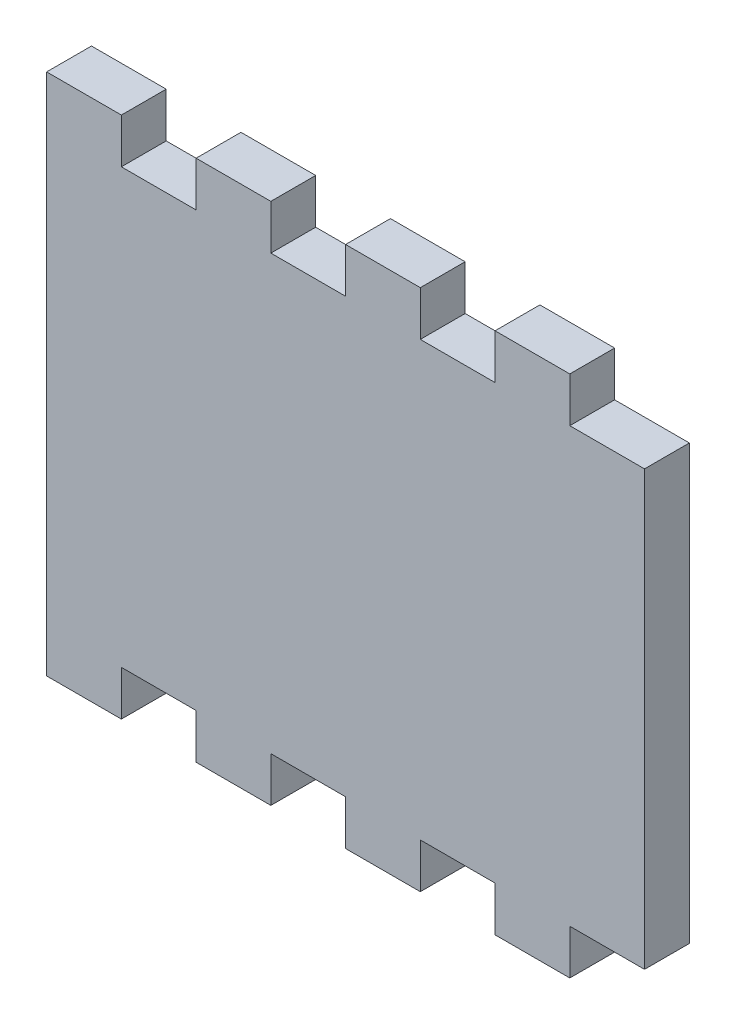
ISO-10303-21;
HEADER;
FILE_DESCRIPTION(('STEP AP214'),'2;1');
FILE_NAME('part.step','',(''),(''),'','','');
FILE_SCHEMA(('AUTOMOTIVE_DESIGN { 1 0 10303 214 1 1 1 1 }'));
ENDSEC;
DATA;
#1=APPLICATION_CONTEXT('core data for automotive mechanical design processes');
#2=APPLICATION_PROTOCOL_DEFINITION('international standard','automotive_design',2000,#1);
#3=PRODUCT_CONTEXT('',#1,'mechanical');
#4=PRODUCT('Part','Part','',(#3));
#5=PRODUCT_RELATED_PRODUCT_CATEGORY('part','',(#4));
#6=PRODUCT_DEFINITION_FORMATION('','',#4);
#7=PRODUCT_DEFINITION_CONTEXT('part definition',#1,'design');
#8=PRODUCT_DEFINITION('design','',#6,#7);
#9=PRODUCT_DEFINITION_SHAPE('','',#8);
#10=(LENGTH_UNIT() NAMED_UNIT(*) SI_UNIT(.MILLI.,.METRE.));
#11=(NAMED_UNIT(*) PLANE_ANGLE_UNIT() SI_UNIT($,.RADIAN.));
#12=(NAMED_UNIT(*) SI_UNIT($,.STERADIAN.) SOLID_ANGLE_UNIT());
#13=UNCERTAINTY_MEASURE_WITH_UNIT(LENGTH_MEASURE(1.E-05),#10,'distance_accuracy_value','');
#14=(GEOMETRIC_REPRESENTATION_CONTEXT(3) GLOBAL_UNCERTAINTY_ASSIGNED_CONTEXT((#13)) GLOBAL_UNIT_ASSIGNED_CONTEXT((#10,
#11,#12)) REPRESENTATION_CONTEXT('',''));
#15=CARTESIAN_POINT('',(0.,0.,0.));
#16=DIRECTION('',(0.,0.,1.));
#17=DIRECTION('',(1.,0.,0.));
#18=AXIS2_PLACEMENT_3D('',#15,#16,#17);
#19=CARTESIAN_POINT('',(-40.,35.,6.));
#20=DIRECTION('',(1.,0.,0.));
#21=DIRECTION('',(0.,0.,-1.));
#22=AXIS2_PLACEMENT_3D('',#19,#20,#21);
#23=PLANE('',#22);
#24=DIRECTION('',(0.,-1.,0.));
#25=VECTOR('',#24,1.);
#26=CARTESIAN_POINT('',(-40.,35.,0.));
#27=LINE('',#26,#25);
#28=CARTESIAN_POINT('',(-40.,35.,0.));
#29=VERTEX_POINT('',#28);
#30=CARTESIAN_POINT('',(-40.,-35.,0.));
#31=VERTEX_POINT('',#30);
#32=EDGE_CURVE('E273',#29,#31,#27,.T.);
#33=ORIENTED_EDGE('',*,*,#32,.T.);
#34=DIRECTION('',(0.,0.,-1.));
#35=VECTOR('',#34,1.);
#36=CARTESIAN_POINT('',(-40.,-35.,6.));
#37=LINE('',#36,#35);
#38=CARTESIAN_POINT('',(-40.,-35.,6.));
#39=VERTEX_POINT('',#38);
#40=EDGE_CURVE('E11',#39,#31,#37,.T.);
#41=ORIENTED_EDGE('',*,*,#40,.F.);
#42=DIRECTION('',(0.,-1.,0.));
#43=VECTOR('',#42,1.);
#44=CARTESIAN_POINT('',(-40.,35.,6.));
#45=LINE('',#44,#43);
#46=CARTESIAN_POINT('',(-40.,35.,6.));
#47=VERTEX_POINT('',#46);
#48=EDGE_CURVE('E335',#47,#39,#45,.T.);
#49=ORIENTED_EDGE('',*,*,#48,.F.);
#50=DIRECTION('',(0.,0.,-1.));
#51=VECTOR('',#50,1.);
#52=CARTESIAN_POINT('',(-40.,35.,6.));
#53=LINE('',#52,#51);
#54=EDGE_CURVE('E269',#47,#29,#53,.T.);
#55=ORIENTED_EDGE('',*,*,#54,.T.);
#56=EDGE_LOOP('',(#33,#41,#49,#55));
#57=FACE_BOUND('',#56,.T.);
#58=ADVANCED_FACE('F33',(#57),#23,.F.);
#59=CARTESIAN_POINT('',(-40.,-35.,6.));
#60=DIRECTION('',(0.,1.,0.));
#61=DIRECTION('',(0.,0.,1.));
#62=AXIS2_PLACEMENT_3D('',#59,#60,#61);
#63=PLANE('',#62);
#64=DIRECTION('',(1.,0.,0.));
#65=VECTOR('',#64,1.);
#66=CARTESIAN_POINT('',(-40.,-35.,0.));
#67=LINE('',#66,#65);
#68=CARTESIAN_POINT('',(-30.,-35.,0.));
#69=VERTEX_POINT('',#68);
#70=EDGE_CURVE('E276',#31,#69,#67,.T.);
#71=ORIENTED_EDGE('',*,*,#70,.T.);
#72=DIRECTION('',(0.,0.,-1.));
#73=VECTOR('',#72,1.);
#74=CARTESIAN_POINT('',(-30.,-35.,6.));
#75=LINE('',#74,#73);
#76=CARTESIAN_POINT('',(-30.,-35.,6.));
#77=VERTEX_POINT('',#76);
#78=EDGE_CURVE('E41',#77,#69,#75,.T.);
#79=ORIENTED_EDGE('',*,*,#78,.F.);
#80=DIRECTION('',(1.,0.,0.));
#81=VECTOR('',#80,1.);
#82=CARTESIAN_POINT('',(-40.,-35.,6.));
#83=LINE('',#82,#81);
#84=EDGE_CURVE('E164',#39,#77,#83,.T.);
#85=ORIENTED_EDGE('',*,*,#84,.F.);
#86=ORIENTED_EDGE('',*,*,#40,.T.);
#87=EDGE_LOOP('',(#71,#79,#85,#86));
#88=FACE_BOUND('',#87,.T.);
#89=ADVANCED_FACE('F513',(#88),#63,.F.);
#90=CARTESIAN_POINT('',(-30.,-35.,6.));
#91=DIRECTION('',(-1.,0.,0.));
#92=DIRECTION('',(0.,-1.,0.));
#93=AXIS2_PLACEMENT_3D('',#90,#91,#92);
#94=PLANE('',#93);
#95=DIRECTION('',(0.,1.,0.));
#96=VECTOR('',#95,1.);
#97=CARTESIAN_POINT('',(-30.,-35.,0.));
#98=LINE('',#97,#96);
#99=CARTESIAN_POINT('',(-30.,-29.,0.));
#100=VERTEX_POINT('',#99);
#101=EDGE_CURVE('E278',#69,#100,#98,.T.);
#102=ORIENTED_EDGE('',*,*,#101,.T.);
#103=DIRECTION('',(0.,0.,-1.));
#104=VECTOR('',#103,1.);
#105=CARTESIAN_POINT('',(-30.,-29.,6.));
#106=LINE('',#105,#104);
#107=CARTESIAN_POINT('',(-30.,-29.,6.));
#108=VERTEX_POINT('',#107);
#109=EDGE_CURVE('E414',#108,#100,#106,.T.);
#110=ORIENTED_EDGE('',*,*,#109,.F.);
#111=DIRECTION('',(0.,1.,0.));
#112=VECTOR('',#111,1.);
#113=CARTESIAN_POINT('',(-30.,-35.,6.));
#114=LINE('',#113,#112);
#115=EDGE_CURVE('E422',#77,#108,#114,.T.);
#116=ORIENTED_EDGE('',*,*,#115,.F.);
#117=ORIENTED_EDGE('',*,*,#78,.T.);
#118=EDGE_LOOP('',(#102,#110,#116,#117));
#119=FACE_BOUND('',#118,.T.);
#120=ADVANCED_FACE('F420',(#119),#94,.F.);
#121=CARTESIAN_POINT('',(-30.,-29.,6.));
#122=DIRECTION('',(0.,1.,0.));
#123=DIRECTION('',(0.,0.,1.));
#124=AXIS2_PLACEMENT_3D('',#121,#122,#123);
#125=PLANE('',#124);
#126=DIRECTION('',(1.,0.,0.));
#127=VECTOR('',#126,1.);
#128=CARTESIAN_POINT('',(-30.,-29.,0.));
#129=LINE('',#128,#127);
#130=CARTESIAN_POINT('',(-20.,-29.,0.));
#131=VERTEX_POINT('',#130);
#132=EDGE_CURVE('E280',#100,#131,#129,.T.);
#133=ORIENTED_EDGE('',*,*,#132,.T.);
#134=DIRECTION('',(0.,0.,-1.));
#135=VECTOR('',#134,1.);
#136=CARTESIAN_POINT('',(-20.,-29.,6.));
#137=LINE('',#136,#135);
#138=CARTESIAN_POINT('',(-20.,-29.,6.));
#139=VERTEX_POINT('',#138);
#140=EDGE_CURVE('E411',#139,#131,#137,.T.);
#141=ORIENTED_EDGE('',*,*,#140,.F.);
#142=DIRECTION('',(1.,0.,0.));
#143=VECTOR('',#142,1.);
#144=CARTESIAN_POINT('',(-30.,-29.,6.));
#145=LINE('',#144,#143);
#146=EDGE_CURVE('E440',#108,#139,#145,.T.);
#147=ORIENTED_EDGE('',*,*,#146,.F.);
#148=ORIENTED_EDGE('',*,*,#109,.T.);
#149=EDGE_LOOP('',(#133,#141,#147,#148));
#150=FACE_BOUND('',#149,.T.);
#151=ADVANCED_FACE('F431',(#150),#125,.F.);
#152=CARTESIAN_POINT('',(-20.,-35.,6.));
#153=DIRECTION('',(1.,0.,0.));
#154=DIRECTION('',(0.,0.,-1.));
#155=AXIS2_PLACEMENT_3D('',#152,#153,#154);
#156=PLANE('',#155);
#157=DIRECTION('',(0.,-1.,0.));
#158=VECTOR('',#157,1.);
#159=CARTESIAN_POINT('',(-20.,-35.,0.));
#160=LINE('',#159,#158);
#161=CARTESIAN_POINT('',(-20.,-35.,0.));
#162=VERTEX_POINT('',#161);
#163=EDGE_CURVE('E282',#131,#162,#160,.T.);
#164=ORIENTED_EDGE('',*,*,#163,.T.);
#165=DIRECTION('',(0.,0.,-1.));
#166=VECTOR('',#165,1.);
#167=CARTESIAN_POINT('',(-20.,-35.,6.));
#168=LINE('',#167,#166);
#169=CARTESIAN_POINT('',(-20.,-35.,6.));
#170=VERTEX_POINT('',#169);
#171=EDGE_CURVE('E408',#170,#162,#168,.T.);
#172=ORIENTED_EDGE('',*,*,#171,.F.);
#173=DIRECTION('',(0.,-1.,0.));
#174=VECTOR('',#173,1.);
#175=CARTESIAN_POINT('',(-20.,-35.,6.));
#176=LINE('',#175,#174);
#177=EDGE_CURVE('E437',#139,#170,#176,.T.);
#178=ORIENTED_EDGE('',*,*,#177,.F.);
#179=ORIENTED_EDGE('',*,*,#140,.T.);
#180=EDGE_LOOP('',(#164,#172,#178,#179));
#181=FACE_BOUND('',#180,.T.);
#182=ADVANCED_FACE('F435',(#181),#156,.F.);
#183=CARTESIAN_POINT('',(-20.,-35.,6.));
#184=DIRECTION('',(0.,1.,0.));
#185=DIRECTION('',(0.,0.,1.));
#186=AXIS2_PLACEMENT_3D('',#183,#184,#185);
#187=PLANE('',#186);
#188=DIRECTION('',(1.,0.,0.));
#189=VECTOR('',#188,1.);
#190=CARTESIAN_POINT('',(-20.,-35.,0.));
#191=LINE('',#190,#189);
#192=CARTESIAN_POINT('',(-10.,-35.,0.));
#193=VERTEX_POINT('',#192);
#194=EDGE_CURVE('E284',#162,#193,#191,.T.);
#195=ORIENTED_EDGE('',*,*,#194,.T.);
#196=DIRECTION('',(0.,0.,-1.));
#197=VECTOR('',#196,1.);
#198=CARTESIAN_POINT('',(-10.,-35.,6.));
#199=LINE('',#198,#197);
#200=CARTESIAN_POINT('',(-10.,-35.,6.));
#201=VERTEX_POINT('',#200);
#202=EDGE_CURVE('E405',#201,#193,#199,.T.);
#203=ORIENTED_EDGE('',*,*,#202,.F.);
#204=DIRECTION('',(1.,0.,0.));
#205=VECTOR('',#204,1.);
#206=CARTESIAN_POINT('',(-20.,-35.,6.));
#207=LINE('',#206,#205);
#208=EDGE_CURVE('E439',#170,#201,#207,.T.);
#209=ORIENTED_EDGE('',*,*,#208,.F.);
#210=ORIENTED_EDGE('',*,*,#171,.T.);
#211=EDGE_LOOP('',(#195,#203,#209,#210));
#212=FACE_BOUND('',#211,.T.);
#213=ADVANCED_FACE('F526',(#212),#187,.F.);
#214=CARTESIAN_POINT('',(-10.,-35.,6.));
#215=DIRECTION('',(-1.,0.,0.));
#216=DIRECTION('',(0.,-1.,0.));
#217=AXIS2_PLACEMENT_3D('',#214,#215,#216);
#218=PLANE('',#217);
#219=DIRECTION('',(0.,1.,0.));
#220=VECTOR('',#219,1.);
#221=CARTESIAN_POINT('',(-10.,-35.,0.));
#222=LINE('',#221,#220);
#223=CARTESIAN_POINT('',(-10.,-29.,0.));
#224=VERTEX_POINT('',#223);
#225=EDGE_CURVE('E286',#193,#224,#222,.T.);
#226=ORIENTED_EDGE('',*,*,#225,.T.);
#227=DIRECTION('',(0.,0.,-1.));
#228=VECTOR('',#227,1.);
#229=CARTESIAN_POINT('',(-10.,-29.,6.));
#230=LINE('',#229,#228);
#231=CARTESIAN_POINT('',(-10.,-29.,6.));
#232=VERTEX_POINT('',#231);
#233=EDGE_CURVE('E402',#232,#224,#230,.T.);
#234=ORIENTED_EDGE('',*,*,#233,.F.);
#235=DIRECTION('',(0.,1.,0.));
#236=VECTOR('',#235,1.);
#237=CARTESIAN_POINT('',(-10.,-35.,6.));
#238=LINE('',#237,#236);
#239=EDGE_CURVE('E442',#201,#232,#238,.T.);
#240=ORIENTED_EDGE('',*,*,#239,.F.);
#241=ORIENTED_EDGE('',*,*,#202,.T.);
#242=EDGE_LOOP('',(#226,#234,#240,#241));
#243=FACE_BOUND('',#242,.T.);
#244=ADVANCED_FACE('F529',(#243),#218,.F.);
#245=CARTESIAN_POINT('',(-10.,-29.,6.));
#246=DIRECTION('',(0.,1.,0.));
#247=DIRECTION('',(0.,0.,1.));
#248=AXIS2_PLACEMENT_3D('',#245,#246,#247);
#249=PLANE('',#248);
#250=DIRECTION('',(1.,0.,0.));
#251=VECTOR('',#250,1.);
#252=CARTESIAN_POINT('',(-10.,-29.,0.));
#253=LINE('',#252,#251);
#254=CARTESIAN_POINT('',(0.,-29.,0.));
#255=VERTEX_POINT('',#254);
#256=EDGE_CURVE('E288',#224,#255,#253,.T.);
#257=ORIENTED_EDGE('',*,*,#256,.T.);
#258=DIRECTION('',(0.,0.,-1.));
#259=VECTOR('',#258,1.);
#260=CARTESIAN_POINT('',(0.,-29.,6.));
#261=LINE('',#260,#259);
#262=CARTESIAN_POINT('',(0.,-29.,6.));
#263=VERTEX_POINT('',#262);
#264=EDGE_CURVE('E399',#263,#255,#261,.T.);
#265=ORIENTED_EDGE('',*,*,#264,.F.);
#266=DIRECTION('',(1.,0.,0.));
#267=VECTOR('',#266,1.);
#268=CARTESIAN_POINT('',(-10.,-29.,6.));
#269=LINE('',#268,#267);
#270=EDGE_CURVE('E448',#232,#263,#269,.T.);
#271=ORIENTED_EDGE('',*,*,#270,.F.);
#272=ORIENTED_EDGE('',*,*,#233,.T.);
#273=EDGE_LOOP('',(#257,#265,#271,#272));
#274=FACE_BOUND('',#273,.T.);
#275=ADVANCED_FACE('F533',(#274),#249,.F.);
#276=CARTESIAN_POINT('',(0.,-35.,6.));
#277=DIRECTION('',(1.,0.,0.));
#278=DIRECTION('',(0.,0.,-1.));
#279=AXIS2_PLACEMENT_3D('',#276,#277,#278);
#280=PLANE('',#279);
#281=DIRECTION('',(0.,-1.,0.));
#282=VECTOR('',#281,1.);
#283=CARTESIAN_POINT('',(0.,-35.,0.));
#284=LINE('',#283,#282);
#285=CARTESIAN_POINT('',(0.,-35.,0.));
#286=VERTEX_POINT('',#285);
#287=EDGE_CURVE('E290',#255,#286,#284,.T.);
#288=ORIENTED_EDGE('',*,*,#287,.T.);
#289=DIRECTION('',(0.,0.,-1.));
#290=VECTOR('',#289,1.);
#291=CARTESIAN_POINT('',(0.,-35.,6.));
#292=LINE('',#291,#290);
#293=CARTESIAN_POINT('',(0.,-35.,6.));
#294=VERTEX_POINT('',#293);
#295=EDGE_CURVE('E396',#294,#286,#292,.T.);
#296=ORIENTED_EDGE('',*,*,#295,.F.);
#297=DIRECTION('',(0.,-1.,0.));
#298=VECTOR('',#297,1.);
#299=CARTESIAN_POINT('',(0.,-35.,6.));
#300=LINE('',#299,#298);
#301=EDGE_CURVE('E450',#263,#294,#300,.T.);
#302=ORIENTED_EDGE('',*,*,#301,.F.);
#303=ORIENTED_EDGE('',*,*,#264,.T.);
#304=EDGE_LOOP('',(#288,#296,#302,#303));
#305=FACE_BOUND('',#304,.T.);
#306=ADVANCED_FACE('F537',(#305),#280,.F.);
#307=CARTESIAN_POINT('',(0.,-35.,6.));
#308=DIRECTION('',(0.,1.,0.));
#309=DIRECTION('',(0.,0.,1.));
#310=AXIS2_PLACEMENT_3D('',#307,#308,#309);
#311=PLANE('',#310);
#312=DIRECTION('',(1.,0.,0.));
#313=VECTOR('',#312,1.);
#314=CARTESIAN_POINT('',(0.,-35.,0.));
#315=LINE('',#314,#313);
#316=CARTESIAN_POINT('',(9.99999999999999,-35.,0.));
#317=VERTEX_POINT('',#316);
#318=EDGE_CURVE('E292',#286,#317,#315,.T.);
#319=ORIENTED_EDGE('',*,*,#318,.T.);
#320=DIRECTION('',(0.,0.,-1.));
#321=VECTOR('',#320,1.);
#322=CARTESIAN_POINT('',(9.99999999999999,-35.,6.));
#323=LINE('',#322,#321);
#324=CARTESIAN_POINT('',(9.99999999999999,-35.,6.));
#325=VERTEX_POINT('',#324);
#326=EDGE_CURVE('E393',#325,#317,#323,.T.);
#327=ORIENTED_EDGE('',*,*,#326,.F.);
#328=DIRECTION('',(1.,0.,0.));
#329=VECTOR('',#328,1.);
#330=CARTESIAN_POINT('',(0.,-35.,6.));
#331=LINE('',#330,#329);
#332=EDGE_CURVE('E452',#294,#325,#331,.T.);
#333=ORIENTED_EDGE('',*,*,#332,.F.);
#334=ORIENTED_EDGE('',*,*,#295,.T.);
#335=EDGE_LOOP('',(#319,#327,#333,#334));
#336=FACE_BOUND('',#335,.T.);
#337=ADVANCED_FACE('F541',(#336),#311,.F.);
#338=CARTESIAN_POINT('',(9.99999999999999,-35.,6.));
#339=DIRECTION('',(-1.,0.,0.));
#340=DIRECTION('',(0.,-1.,0.));
#341=AXIS2_PLACEMENT_3D('',#338,#339,#340);
#342=PLANE('',#341);
#343=DIRECTION('',(0.,1.,0.));
#344=VECTOR('',#343,1.);
#345=CARTESIAN_POINT('',(9.99999999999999,-35.,0.));
#346=LINE('',#345,#344);
#347=CARTESIAN_POINT('',(9.99999999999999,-29.,0.));
#348=VERTEX_POINT('',#347);
#349=EDGE_CURVE('E294',#317,#348,#346,.T.);
#350=ORIENTED_EDGE('',*,*,#349,.T.);
#351=DIRECTION('',(0.,0.,-1.));
#352=VECTOR('',#351,1.);
#353=CARTESIAN_POINT('',(9.99999999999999,-29.,6.));
#354=LINE('',#353,#352);
#355=CARTESIAN_POINT('',(9.99999999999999,-29.,6.));
#356=VERTEX_POINT('',#355);
#357=EDGE_CURVE('E390',#356,#348,#354,.T.);
#358=ORIENTED_EDGE('',*,*,#357,.F.);
#359=DIRECTION('',(0.,1.,0.));
#360=VECTOR('',#359,1.);
#361=CARTESIAN_POINT('',(9.99999999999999,-35.,6.));
#362=LINE('',#361,#360);
#363=EDGE_CURVE('E454',#325,#356,#362,.T.);
#364=ORIENTED_EDGE('',*,*,#363,.F.);
#365=ORIENTED_EDGE('',*,*,#326,.T.);
#366=EDGE_LOOP('',(#350,#358,#364,#365));
#367=FACE_BOUND('',#366,.T.);
#368=ADVANCED_FACE('F545',(#367),#342,.F.);
#369=CARTESIAN_POINT('',(9.99999999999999,-29.,6.));
#370=DIRECTION('',(0.,1.,0.));
#371=DIRECTION('',(0.,0.,1.));
#372=AXIS2_PLACEMENT_3D('',#369,#370,#371);
#373=PLANE('',#372);
#374=DIRECTION('',(1.,0.,0.));
#375=VECTOR('',#374,1.);
#376=CARTESIAN_POINT('',(9.99999999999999,-29.,0.));
#377=LINE('',#376,#375);
#378=CARTESIAN_POINT('',(20.,-29.,0.));
#379=VERTEX_POINT('',#378);
#380=EDGE_CURVE('E296',#348,#379,#377,.T.);
#381=ORIENTED_EDGE('',*,*,#380,.T.);
#382=DIRECTION('',(0.,0.,-1.));
#383=VECTOR('',#382,1.);
#384=CARTESIAN_POINT('',(20.,-29.,6.));
#385=LINE('',#384,#383);
#386=CARTESIAN_POINT('',(20.,-29.,6.));
#387=VERTEX_POINT('',#386);
#388=EDGE_CURVE('E387',#387,#379,#385,.T.);
#389=ORIENTED_EDGE('',*,*,#388,.F.);
#390=DIRECTION('',(1.,0.,0.));
#391=VECTOR('',#390,1.);
#392=CARTESIAN_POINT('',(9.99999999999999,-29.,6.));
#393=LINE('',#392,#391);
#394=EDGE_CURVE('E456',#356,#387,#393,.T.);
#395=ORIENTED_EDGE('',*,*,#394,.F.);
#396=ORIENTED_EDGE('',*,*,#357,.T.);
#397=EDGE_LOOP('',(#381,#389,#395,#396));
#398=FACE_BOUND('',#397,.T.);
#399=ADVANCED_FACE('F549',(#398),#373,.F.);
#400=CARTESIAN_POINT('',(20.,-35.,6.));
#401=DIRECTION('',(1.,0.,0.));
#402=DIRECTION('',(0.,0.,-1.));
#403=AXIS2_PLACEMENT_3D('',#400,#401,#402);
#404=PLANE('',#403);
#405=DIRECTION('',(0.,-1.,0.));
#406=VECTOR('',#405,1.);
#407=CARTESIAN_POINT('',(20.,-35.,0.));
#408=LINE('',#407,#406);
#409=CARTESIAN_POINT('',(20.,-35.,0.));
#410=VERTEX_POINT('',#409);
#411=EDGE_CURVE('E298',#379,#410,#408,.T.);
#412=ORIENTED_EDGE('',*,*,#411,.T.);
#413=DIRECTION('',(0.,0.,-1.));
#414=VECTOR('',#413,1.);
#415=CARTESIAN_POINT('',(20.,-35.,6.));
#416=LINE('',#415,#414);
#417=CARTESIAN_POINT('',(20.,-35.,6.));
#418=VERTEX_POINT('',#417);
#419=EDGE_CURVE('E384',#418,#410,#416,.T.);
#420=ORIENTED_EDGE('',*,*,#419,.F.);
#421=DIRECTION('',(0.,-1.,0.));
#422=VECTOR('',#421,1.);
#423=CARTESIAN_POINT('',(20.,-35.,6.));
#424=LINE('',#423,#422);
#425=EDGE_CURVE('E458',#387,#418,#424,.T.);
#426=ORIENTED_EDGE('',*,*,#425,.F.);
#427=ORIENTED_EDGE('',*,*,#388,.T.);
#428=EDGE_LOOP('',(#412,#420,#426,#427));
#429=FACE_BOUND('',#428,.T.);
#430=ADVANCED_FACE('F553',(#429),#404,.F.);
#431=CARTESIAN_POINT('',(20.,-35.,6.));
#432=DIRECTION('',(0.,1.,0.));
#433=DIRECTION('',(0.,0.,1.));
#434=AXIS2_PLACEMENT_3D('',#431,#432,#433);
#435=PLANE('',#434);
#436=DIRECTION('',(1.,0.,0.));
#437=VECTOR('',#436,1.);
#438=CARTESIAN_POINT('',(20.,-35.,0.));
#439=LINE('',#438,#437);
#440=CARTESIAN_POINT('',(30.,-35.,0.));
#441=VERTEX_POINT('',#440);
#442=EDGE_CURVE('E300',#410,#441,#439,.T.);
#443=ORIENTED_EDGE('',*,*,#442,.T.);
#444=DIRECTION('',(0.,0.,-1.));
#445=VECTOR('',#444,1.);
#446=CARTESIAN_POINT('',(30.,-35.,6.));
#447=LINE('',#446,#445);
#448=CARTESIAN_POINT('',(30.,-35.,6.));
#449=VERTEX_POINT('',#448);
#450=EDGE_CURVE('E381',#449,#441,#447,.T.);
#451=ORIENTED_EDGE('',*,*,#450,.F.);
#452=DIRECTION('',(1.,0.,0.));
#453=VECTOR('',#452,1.);
#454=CARTESIAN_POINT('',(20.,-35.,6.));
#455=LINE('',#454,#453);
#456=EDGE_CURVE('E460',#418,#449,#455,.T.);
#457=ORIENTED_EDGE('',*,*,#456,.F.);
#458=ORIENTED_EDGE('',*,*,#419,.T.);
#459=EDGE_LOOP('',(#443,#451,#457,#458));
#460=FACE_BOUND('',#459,.T.);
#461=ADVANCED_FACE('F557',(#460),#435,.F.);
#462=CARTESIAN_POINT('',(30.,-35.,6.));
#463=DIRECTION('',(-1.,0.,0.));
#464=DIRECTION('',(0.,-1.,0.));
#465=AXIS2_PLACEMENT_3D('',#462,#463,#464);
#466=PLANE('',#465);
#467=DIRECTION('',(0.,1.,0.));
#468=VECTOR('',#467,1.);
#469=CARTESIAN_POINT('',(30.,-35.,0.));
#470=LINE('',#469,#468);
#471=CARTESIAN_POINT('',(30.,-29.,0.));
#472=VERTEX_POINT('',#471);
#473=EDGE_CURVE('E302',#441,#472,#470,.T.);
#474=ORIENTED_EDGE('',*,*,#473,.T.);
#475=DIRECTION('',(0.,0.,-1.));
#476=VECTOR('',#475,1.);
#477=CARTESIAN_POINT('',(30.,-29.,6.));
#478=LINE('',#477,#476);
#479=CARTESIAN_POINT('',(30.,-29.,6.));
#480=VERTEX_POINT('',#479);
#481=EDGE_CURVE('E378',#480,#472,#478,.T.);
#482=ORIENTED_EDGE('',*,*,#481,.F.);
#483=DIRECTION('',(0.,1.,0.));
#484=VECTOR('',#483,1.);
#485=CARTESIAN_POINT('',(30.,-35.,6.));
#486=LINE('',#485,#484);
#487=EDGE_CURVE('E462',#449,#480,#486,.T.);
#488=ORIENTED_EDGE('',*,*,#487,.F.);
#489=ORIENTED_EDGE('',*,*,#450,.T.);
#490=EDGE_LOOP('',(#474,#482,#488,#489));
#491=FACE_BOUND('',#490,.T.);
#492=ADVANCED_FACE('F561',(#491),#466,.F.);
#493=CARTESIAN_POINT('',(30.,-29.,6.));
#494=DIRECTION('',(0.,1.,0.));
#495=DIRECTION('',(0.,0.,1.));
#496=AXIS2_PLACEMENT_3D('',#493,#494,#495);
#497=PLANE('',#496);
#498=DIRECTION('',(1.,0.,0.));
#499=VECTOR('',#498,1.);
#500=CARTESIAN_POINT('',(30.,-29.,0.));
#501=LINE('',#500,#499);
#502=CARTESIAN_POINT('',(40.,-29.,0.));
#503=VERTEX_POINT('',#502);
#504=EDGE_CURVE('E304',#472,#503,#501,.T.);
#505=ORIENTED_EDGE('',*,*,#504,.T.);
#506=DIRECTION('',(0.,0.,-1.));
#507=VECTOR('',#506,1.);
#508=CARTESIAN_POINT('',(40.,-29.,6.));
#509=LINE('',#508,#507);
#510=CARTESIAN_POINT('',(40.,-29.,6.));
#511=VERTEX_POINT('',#510);
#512=EDGE_CURVE('E375',#511,#503,#509,.T.);
#513=ORIENTED_EDGE('',*,*,#512,.F.);
#514=DIRECTION('',(1.,0.,0.));
#515=VECTOR('',#514,1.);
#516=CARTESIAN_POINT('',(30.,-29.,6.));
#517=LINE('',#516,#515);
#518=EDGE_CURVE('E464',#480,#511,#517,.T.);
#519=ORIENTED_EDGE('',*,*,#518,.F.);
#520=ORIENTED_EDGE('',*,*,#481,.T.);
#521=EDGE_LOOP('',(#505,#513,#519,#520));
#522=FACE_BOUND('',#521,.T.);
#523=ADVANCED_FACE('F565',(#522),#497,.F.);
#524=CARTESIAN_POINT('',(40.,29.,6.));
#525=DIRECTION('',(-1.,0.,0.));
#526=DIRECTION('',(0.,0.,1.));
#527=AXIS2_PLACEMENT_3D('',#524,#525,#526);
#528=PLANE('',#527);
#529=DIRECTION('',(0.,1.,0.));
#530=VECTOR('',#529,1.);
#531=CARTESIAN_POINT('',(40.,29.,0.));
#532=LINE('',#531,#530);
#533=CARTESIAN_POINT('',(40.,29.,0.));
#534=VERTEX_POINT('',#533);
#535=EDGE_CURVE('E306',#503,#534,#532,.T.);
#536=ORIENTED_EDGE('',*,*,#535,.T.);
#537=DIRECTION('',(0.,0.,-1.));
#538=VECTOR('',#537,1.);
#539=CARTESIAN_POINT('',(40.,29.,6.));
#540=LINE('',#539,#538);
#541=CARTESIAN_POINT('',(40.,29.,6.));
#542=VERTEX_POINT('',#541);
#543=EDGE_CURVE('E372',#542,#534,#540,.T.);
#544=ORIENTED_EDGE('',*,*,#543,.F.);
#545=DIRECTION('',(0.,1.,0.));
#546=VECTOR('',#545,1.);
#547=CARTESIAN_POINT('',(40.,29.,6.));
#548=LINE('',#547,#546);
#549=EDGE_CURVE('E466',#511,#542,#548,.T.);
#550=ORIENTED_EDGE('',*,*,#549,.F.);
#551=ORIENTED_EDGE('',*,*,#512,.T.);
#552=EDGE_LOOP('',(#536,#544,#550,#551));
#553=FACE_BOUND('',#552,.T.);
#554=ADVANCED_FACE('F569',(#553),#528,.F.);
#555=CARTESIAN_POINT('',(30.,29.,6.));
#556=DIRECTION('',(0.,-1.,0.));
#557=DIRECTION('',(0.,0.,-1.));
#558=AXIS2_PLACEMENT_3D('',#555,#556,#557);
#559=PLANE('',#558);
#560=DIRECTION('',(-1.,0.,0.));
#561=VECTOR('',#560,1.);
#562=CARTESIAN_POINT('',(30.,29.,0.));
#563=LINE('',#562,#561);
#564=CARTESIAN_POINT('',(30.,29.,0.));
#565=VERTEX_POINT('',#564);
#566=EDGE_CURVE('E308',#534,#565,#563,.T.);
#567=ORIENTED_EDGE('',*,*,#566,.T.);
#568=DIRECTION('',(0.,0.,-1.));
#569=VECTOR('',#568,1.);
#570=CARTESIAN_POINT('',(30.,29.,6.));
#571=LINE('',#570,#569);
#572=CARTESIAN_POINT('',(30.,29.,6.));
#573=VERTEX_POINT('',#572);
#574=EDGE_CURVE('E369',#573,#565,#571,.T.);
#575=ORIENTED_EDGE('',*,*,#574,.F.);
#576=DIRECTION('',(-1.,0.,0.));
#577=VECTOR('',#576,1.);
#578=CARTESIAN_POINT('',(30.,29.,6.));
#579=LINE('',#578,#577);
#580=EDGE_CURVE('E468',#542,#573,#579,.T.);
#581=ORIENTED_EDGE('',*,*,#580,.F.);
#582=ORIENTED_EDGE('',*,*,#543,.T.);
#583=EDGE_LOOP('',(#567,#575,#581,#582));
#584=FACE_BOUND('',#583,.T.);
#585=ADVANCED_FACE('F573',(#584),#559,.F.);
#586=CARTESIAN_POINT('',(30.,35.,6.));
#587=DIRECTION('',(-1.,0.,0.));
#588=DIRECTION('',(0.,-1.,0.));
#589=AXIS2_PLACEMENT_3D('',#586,#587,#588);
#590=PLANE('',#589);
#591=DIRECTION('',(0.,1.,0.));
#592=VECTOR('',#591,1.);
#593=CARTESIAN_POINT('',(30.,35.,0.));
#594=LINE('',#593,#592);
#595=CARTESIAN_POINT('',(30.,35.,0.));
#596=VERTEX_POINT('',#595);
#597=EDGE_CURVE('E310',#565,#596,#594,.T.);
#598=ORIENTED_EDGE('',*,*,#597,.T.);
#599=DIRECTION('',(0.,0.,-1.));
#600=VECTOR('',#599,1.);
#601=CARTESIAN_POINT('',(30.,35.,6.));
#602=LINE('',#601,#600);
#603=CARTESIAN_POINT('',(30.,35.,6.));
#604=VERTEX_POINT('',#603);
#605=EDGE_CURVE('E366',#604,#596,#602,.T.);
#606=ORIENTED_EDGE('',*,*,#605,.F.);
#607=DIRECTION('',(0.,1.,0.));
#608=VECTOR('',#607,1.);
#609=CARTESIAN_POINT('',(30.,35.,6.));
#610=LINE('',#609,#608);
#611=EDGE_CURVE('E470',#573,#604,#610,.T.);
#612=ORIENTED_EDGE('',*,*,#611,.F.);
#613=ORIENTED_EDGE('',*,*,#574,.T.);
#614=EDGE_LOOP('',(#598,#606,#612,#613));
#615=FACE_BOUND('',#614,.T.);
#616=ADVANCED_FACE('F577',(#615),#590,.F.);
#617=CARTESIAN_POINT('',(20.,35.,6.));
#618=DIRECTION('',(0.,-1.,0.));
#619=DIRECTION('',(0.,0.,-1.));
#620=AXIS2_PLACEMENT_3D('',#617,#618,#619);
#621=PLANE('',#620);
#622=DIRECTION('',(-1.,0.,0.));
#623=VECTOR('',#622,1.);
#624=CARTESIAN_POINT('',(20.,35.,0.));
#625=LINE('',#624,#623);
#626=CARTESIAN_POINT('',(20.,35.,0.));
#627=VERTEX_POINT('',#626);
#628=EDGE_CURVE('E312',#596,#627,#625,.T.);
#629=ORIENTED_EDGE('',*,*,#628,.T.);
#630=DIRECTION('',(0.,0.,-1.));
#631=VECTOR('',#630,1.);
#632=CARTESIAN_POINT('',(20.,35.,6.));
#633=LINE('',#632,#631);
#634=CARTESIAN_POINT('',(20.,35.,6.));
#635=VERTEX_POINT('',#634);
#636=EDGE_CURVE('E363',#635,#627,#633,.T.);
#637=ORIENTED_EDGE('',*,*,#636,.F.);
#638=DIRECTION('',(-1.,0.,0.));
#639=VECTOR('',#638,1.);
#640=CARTESIAN_POINT('',(20.,35.,6.));
#641=LINE('',#640,#639);
#642=EDGE_CURVE('E472',#604,#635,#641,.T.);
#643=ORIENTED_EDGE('',*,*,#642,.F.);
#644=ORIENTED_EDGE('',*,*,#605,.T.);
#645=EDGE_LOOP('',(#629,#637,#643,#644));
#646=FACE_BOUND('',#645,.T.);
#647=ADVANCED_FACE('F581',(#646),#621,.F.);
#648=CARTESIAN_POINT('',(20.,35.,6.));
#649=DIRECTION('',(1.,0.,0.));
#650=DIRECTION('',(0.,0.,-1.));
#651=AXIS2_PLACEMENT_3D('',#648,#649,#650);
#652=PLANE('',#651);
#653=DIRECTION('',(0.,-1.,0.));
#654=VECTOR('',#653,1.);
#655=CARTESIAN_POINT('',(20.,35.,0.));
#656=LINE('',#655,#654);
#657=CARTESIAN_POINT('',(20.,29.,0.));
#658=VERTEX_POINT('',#657);
#659=EDGE_CURVE('E314',#627,#658,#656,.T.);
#660=ORIENTED_EDGE('',*,*,#659,.T.);
#661=DIRECTION('',(0.,0.,-1.));
#662=VECTOR('',#661,1.);
#663=CARTESIAN_POINT('',(20.,29.,6.));
#664=LINE('',#663,#662);
#665=CARTESIAN_POINT('',(20.,29.,6.));
#666=VERTEX_POINT('',#665);
#667=EDGE_CURVE('E360',#666,#658,#664,.T.);
#668=ORIENTED_EDGE('',*,*,#667,.F.);
#669=DIRECTION('',(0.,-1.,0.));
#670=VECTOR('',#669,1.);
#671=CARTESIAN_POINT('',(20.,35.,6.));
#672=LINE('',#671,#670);
#673=EDGE_CURVE('E474',#635,#666,#672,.T.);
#674=ORIENTED_EDGE('',*,*,#673,.F.);
#675=ORIENTED_EDGE('',*,*,#636,.T.);
#676=EDGE_LOOP('',(#660,#668,#674,#675));
#677=FACE_BOUND('',#676,.T.);
#678=ADVANCED_FACE('F585',(#677),#652,.F.);
#679=CARTESIAN_POINT('',(9.99999999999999,29.,6.));
#680=DIRECTION('',(0.,-1.,0.));
#681=DIRECTION('',(0.,0.,-1.));
#682=AXIS2_PLACEMENT_3D('',#679,#680,#681);
#683=PLANE('',#682);
#684=DIRECTION('',(-1.,0.,0.));
#685=VECTOR('',#684,1.);
#686=CARTESIAN_POINT('',(9.99999999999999,29.,0.));
#687=LINE('',#686,#685);
#688=CARTESIAN_POINT('',(9.99999999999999,29.,0.));
#689=VERTEX_POINT('',#688);
#690=EDGE_CURVE('E316',#658,#689,#687,.T.);
#691=ORIENTED_EDGE('',*,*,#690,.T.);
#692=DIRECTION('',(0.,0.,-1.));
#693=VECTOR('',#692,1.);
#694=CARTESIAN_POINT('',(9.99999999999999,29.,6.));
#695=LINE('',#694,#693);
#696=CARTESIAN_POINT('',(9.99999999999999,29.,6.));
#697=VERTEX_POINT('',#696);
#698=EDGE_CURVE('E357',#697,#689,#695,.T.);
#699=ORIENTED_EDGE('',*,*,#698,.F.);
#700=DIRECTION('',(-1.,0.,0.));
#701=VECTOR('',#700,1.);
#702=CARTESIAN_POINT('',(9.99999999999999,29.,6.));
#703=LINE('',#702,#701);
#704=EDGE_CURVE('E476',#666,#697,#703,.T.);
#705=ORIENTED_EDGE('',*,*,#704,.F.);
#706=ORIENTED_EDGE('',*,*,#667,.T.);
#707=EDGE_LOOP('',(#691,#699,#705,#706));
#708=FACE_BOUND('',#707,.T.);
#709=ADVANCED_FACE('F589',(#708),#683,.F.);
#710=CARTESIAN_POINT('',(9.99999999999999,35.,6.));
#711=DIRECTION('',(-1.,0.,0.));
#712=DIRECTION('',(0.,-1.,0.));
#713=AXIS2_PLACEMENT_3D('',#710,#711,#712);
#714=PLANE('',#713);
#715=DIRECTION('',(0.,1.,0.));
#716=VECTOR('',#715,1.);
#717=CARTESIAN_POINT('',(9.99999999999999,35.,0.));
#718=LINE('',#717,#716);
#719=CARTESIAN_POINT('',(9.99999999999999,35.,0.));
#720=VERTEX_POINT('',#719);
#721=EDGE_CURVE('E318',#689,#720,#718,.T.);
#722=ORIENTED_EDGE('',*,*,#721,.T.);
#723=DIRECTION('',(0.,0.,-1.));
#724=VECTOR('',#723,1.);
#725=CARTESIAN_POINT('',(9.99999999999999,35.,6.));
#726=LINE('',#725,#724);
#727=CARTESIAN_POINT('',(9.99999999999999,35.,6.));
#728=VERTEX_POINT('',#727);
#729=EDGE_CURVE('E354',#728,#720,#726,.T.);
#730=ORIENTED_EDGE('',*,*,#729,.F.);
#731=DIRECTION('',(0.,1.,0.));
#732=VECTOR('',#731,1.);
#733=CARTESIAN_POINT('',(9.99999999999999,35.,6.));
#734=LINE('',#733,#732);
#735=EDGE_CURVE('E478',#697,#728,#734,.T.);
#736=ORIENTED_EDGE('',*,*,#735,.F.);
#737=ORIENTED_EDGE('',*,*,#698,.T.);
#738=EDGE_LOOP('',(#722,#730,#736,#737));
#739=FACE_BOUND('',#738,.T.);
#740=ADVANCED_FACE('F593',(#739),#714,.F.);
#741=CARTESIAN_POINT('',(0.,35.,6.));
#742=DIRECTION('',(0.,-1.,0.));
#743=DIRECTION('',(0.,0.,-1.));
#744=AXIS2_PLACEMENT_3D('',#741,#742,#743);
#745=PLANE('',#744);
#746=DIRECTION('',(-1.,0.,0.));
#747=VECTOR('',#746,1.);
#748=CARTESIAN_POINT('',(0.,35.,0.));
#749=LINE('',#748,#747);
#750=CARTESIAN_POINT('',(0.,35.,0.));
#751=VERTEX_POINT('',#750);
#752=EDGE_CURVE('E320',#720,#751,#749,.T.);
#753=ORIENTED_EDGE('',*,*,#752,.T.);
#754=DIRECTION('',(0.,0.,-1.));
#755=VECTOR('',#754,1.);
#756=CARTESIAN_POINT('',(0.,35.,6.));
#757=LINE('',#756,#755);
#758=CARTESIAN_POINT('',(0.,35.,6.));
#759=VERTEX_POINT('',#758);
#760=EDGE_CURVE('E351',#759,#751,#757,.T.);
#761=ORIENTED_EDGE('',*,*,#760,.F.);
#762=DIRECTION('',(-1.,0.,0.));
#763=VECTOR('',#762,1.);
#764=CARTESIAN_POINT('',(0.,35.,6.));
#765=LINE('',#764,#763);
#766=EDGE_CURVE('E480',#728,#759,#765,.T.);
#767=ORIENTED_EDGE('',*,*,#766,.F.);
#768=ORIENTED_EDGE('',*,*,#729,.T.);
#769=EDGE_LOOP('',(#753,#761,#767,#768));
#770=FACE_BOUND('',#769,.T.);
#771=ADVANCED_FACE('F597',(#770),#745,.F.);
#772=CARTESIAN_POINT('',(0.,35.,6.));
#773=DIRECTION('',(1.,0.,0.));
#774=DIRECTION('',(0.,0.,-1.));
#775=AXIS2_PLACEMENT_3D('',#772,#773,#774);
#776=PLANE('',#775);
#777=DIRECTION('',(0.,-1.,0.));
#778=VECTOR('',#777,1.);
#779=CARTESIAN_POINT('',(0.,35.,0.));
#780=LINE('',#779,#778);
#781=CARTESIAN_POINT('',(0.,29.,0.));
#782=VERTEX_POINT('',#781);
#783=EDGE_CURVE('E322',#751,#782,#780,.T.);
#784=ORIENTED_EDGE('',*,*,#783,.T.);
#785=DIRECTION('',(0.,0.,-1.));
#786=VECTOR('',#785,1.);
#787=CARTESIAN_POINT('',(0.,29.,6.));
#788=LINE('',#787,#786);
#789=CARTESIAN_POINT('',(0.,29.,6.));
#790=VERTEX_POINT('',#789);
#791=EDGE_CURVE('E348',#790,#782,#788,.T.);
#792=ORIENTED_EDGE('',*,*,#791,.F.);
#793=DIRECTION('',(0.,-1.,0.));
#794=VECTOR('',#793,1.);
#795=CARTESIAN_POINT('',(0.,35.,6.));
#796=LINE('',#795,#794);
#797=EDGE_CURVE('E482',#759,#790,#796,.T.);
#798=ORIENTED_EDGE('',*,*,#797,.F.);
#799=ORIENTED_EDGE('',*,*,#760,.T.);
#800=EDGE_LOOP('',(#784,#792,#798,#799));
#801=FACE_BOUND('',#800,.T.);
#802=ADVANCED_FACE('F601',(#801),#776,.F.);
#803=CARTESIAN_POINT('',(-10.,29.,6.));
#804=DIRECTION('',(0.,-1.,0.));
#805=DIRECTION('',(0.,0.,-1.));
#806=AXIS2_PLACEMENT_3D('',#803,#804,#805);
#807=PLANE('',#806);
#808=DIRECTION('',(-1.,0.,0.));
#809=VECTOR('',#808,1.);
#810=CARTESIAN_POINT('',(-10.,29.,0.));
#811=LINE('',#810,#809);
#812=CARTESIAN_POINT('',(-10.,29.,0.));
#813=VERTEX_POINT('',#812);
#814=EDGE_CURVE('E324',#782,#813,#811,.T.);
#815=ORIENTED_EDGE('',*,*,#814,.T.);
#816=DIRECTION('',(0.,0.,-1.));
#817=VECTOR('',#816,1.);
#818=CARTESIAN_POINT('',(-10.,29.,6.));
#819=LINE('',#818,#817);
#820=CARTESIAN_POINT('',(-10.,29.,6.));
#821=VERTEX_POINT('',#820);
#822=EDGE_CURVE('E345',#821,#813,#819,.T.);
#823=ORIENTED_EDGE('',*,*,#822,.F.);
#824=DIRECTION('',(-1.,0.,0.));
#825=VECTOR('',#824,1.);
#826=CARTESIAN_POINT('',(-10.,29.,6.));
#827=LINE('',#826,#825);
#828=EDGE_CURVE('E484',#790,#821,#827,.T.);
#829=ORIENTED_EDGE('',*,*,#828,.F.);
#830=ORIENTED_EDGE('',*,*,#791,.T.);
#831=EDGE_LOOP('',(#815,#823,#829,#830));
#832=FACE_BOUND('',#831,.T.);
#833=ADVANCED_FACE('F605',(#832),#807,.F.);
#834=CARTESIAN_POINT('',(-10.,35.,6.));
#835=DIRECTION('',(-1.,0.,0.));
#836=DIRECTION('',(0.,-1.,0.));
#837=AXIS2_PLACEMENT_3D('',#834,#835,#836);
#838=PLANE('',#837);
#839=DIRECTION('',(0.,1.,0.));
#840=VECTOR('',#839,1.);
#841=CARTESIAN_POINT('',(-10.,35.,0.));
#842=LINE('',#841,#840);
#843=CARTESIAN_POINT('',(-10.,35.,0.));
#844=VERTEX_POINT('',#843);
#845=EDGE_CURVE('E326',#813,#844,#842,.T.);
#846=ORIENTED_EDGE('',*,*,#845,.T.);
#847=DIRECTION('',(0.,0.,-1.));
#848=VECTOR('',#847,1.);
#849=CARTESIAN_POINT('',(-10.,35.,6.));
#850=LINE('',#849,#848);
#851=CARTESIAN_POINT('',(-10.,35.,6.));
#852=VERTEX_POINT('',#851);
#853=EDGE_CURVE('E342',#852,#844,#850,.T.);
#854=ORIENTED_EDGE('',*,*,#853,.F.);
#855=DIRECTION('',(0.,1.,0.));
#856=VECTOR('',#855,1.);
#857=CARTESIAN_POINT('',(-10.,35.,6.));
#858=LINE('',#857,#856);
#859=EDGE_CURVE('E486',#821,#852,#858,.T.);
#860=ORIENTED_EDGE('',*,*,#859,.F.);
#861=ORIENTED_EDGE('',*,*,#822,.T.);
#862=EDGE_LOOP('',(#846,#854,#860,#861));
#863=FACE_BOUND('',#862,.T.);
#864=ADVANCED_FACE('F609',(#863),#838,.F.);
#865=CARTESIAN_POINT('',(-20.,35.,6.));
#866=DIRECTION('',(0.,-1.,0.));
#867=DIRECTION('',(0.,0.,-1.));
#868=AXIS2_PLACEMENT_3D('',#865,#866,#867);
#869=PLANE('',#868);
#870=DIRECTION('',(-1.,0.,0.));
#871=VECTOR('',#870,1.);
#872=CARTESIAN_POINT('',(-20.,35.,0.));
#873=LINE('',#872,#871);
#874=CARTESIAN_POINT('',(-20.,35.,0.));
#875=VERTEX_POINT('',#874);
#876=EDGE_CURVE('E328',#844,#875,#873,.T.);
#877=ORIENTED_EDGE('',*,*,#876,.T.);
#878=DIRECTION('',(0.,0.,-1.));
#879=VECTOR('',#878,1.);
#880=CARTESIAN_POINT('',(-20.,35.,6.));
#881=LINE('',#880,#879);
#882=CARTESIAN_POINT('',(-20.,35.,6.));
#883=VERTEX_POINT('',#882);
#884=EDGE_CURVE('E339',#883,#875,#881,.T.);
#885=ORIENTED_EDGE('',*,*,#884,.F.);
#886=DIRECTION('',(-1.,0.,0.));
#887=VECTOR('',#886,1.);
#888=CARTESIAN_POINT('',(-20.,35.,6.));
#889=LINE('',#888,#887);
#890=EDGE_CURVE('E488',#852,#883,#889,.T.);
#891=ORIENTED_EDGE('',*,*,#890,.F.);
#892=ORIENTED_EDGE('',*,*,#853,.T.);
#893=EDGE_LOOP('',(#877,#885,#891,#892));
#894=FACE_BOUND('',#893,.T.);
#895=ADVANCED_FACE('F494',(#894),#869,.F.);
#896=CARTESIAN_POINT('',(-20.,35.,6.));
#897=DIRECTION('',(1.,0.,0.));
#898=DIRECTION('',(0.,0.,-1.));
#899=AXIS2_PLACEMENT_3D('',#896,#897,#898);
#900=PLANE('',#899);
#901=DIRECTION('',(0.,-1.,0.));
#902=VECTOR('',#901,1.);
#903=CARTESIAN_POINT('',(-20.,35.,0.));
#904=LINE('',#903,#902);
#905=CARTESIAN_POINT('',(-20.,29.,0.));
#906=VERTEX_POINT('',#905);
#907=EDGE_CURVE('E330',#875,#906,#904,.T.);
#908=ORIENTED_EDGE('',*,*,#907,.T.);
#909=DIRECTION('',(0.,0.,-1.));
#910=VECTOR('',#909,1.);
#911=CARTESIAN_POINT('',(-20.,29.,6.));
#912=LINE('',#911,#910);
#913=CARTESIAN_POINT('',(-20.,29.,6.));
#914=VERTEX_POINT('',#913);
#915=EDGE_CURVE('E264',#914,#906,#912,.T.);
#916=ORIENTED_EDGE('',*,*,#915,.F.);
#917=DIRECTION('',(0.,-1.,0.));
#918=VECTOR('',#917,1.);
#919=CARTESIAN_POINT('',(-20.,35.,6.));
#920=LINE('',#919,#918);
#921=EDGE_CURVE('E255',#883,#914,#920,.T.);
#922=ORIENTED_EDGE('',*,*,#921,.F.);
#923=ORIENTED_EDGE('',*,*,#884,.T.);
#924=EDGE_LOOP('',(#908,#916,#922,#923));
#925=FACE_BOUND('',#924,.T.);
#926=ADVANCED_FACE('F498',(#925),#900,.F.);
#927=CARTESIAN_POINT('',(-30.,29.,6.));
#928=DIRECTION('',(0.,-1.,0.));
#929=DIRECTION('',(0.,0.,-1.));
#930=AXIS2_PLACEMENT_3D('',#927,#928,#929);
#931=PLANE('',#930);
#932=DIRECTION('',(-1.,0.,0.));
#933=VECTOR('',#932,1.);
#934=CARTESIAN_POINT('',(-30.,29.,0.));
#935=LINE('',#934,#933);
#936=CARTESIAN_POINT('',(-30.,29.,0.));
#937=VERTEX_POINT('',#936);
#938=EDGE_CURVE('E263',#906,#937,#935,.T.);
#939=ORIENTED_EDGE('',*,*,#938,.T.);
#940=DIRECTION('',(0.,0.,-1.));
#941=VECTOR('',#940,1.);
#942=CARTESIAN_POINT('',(-30.,29.,6.));
#943=LINE('',#942,#941);
#944=CARTESIAN_POINT('',(-30.,29.,6.));
#945=VERTEX_POINT('',#944);
#946=EDGE_CURVE('E260',#945,#937,#943,.T.);
#947=ORIENTED_EDGE('',*,*,#946,.F.);
#948=DIRECTION('',(-1.,0.,0.));
#949=VECTOR('',#948,1.);
#950=CARTESIAN_POINT('',(-30.,29.,6.));
#951=LINE('',#950,#949);
#952=EDGE_CURVE('E249',#914,#945,#951,.T.);
#953=ORIENTED_EDGE('',*,*,#952,.F.);
#954=ORIENTED_EDGE('',*,*,#915,.T.);
#955=EDGE_LOOP('',(#939,#947,#953,#954));
#956=FACE_BOUND('',#955,.T.);
#957=ADVANCED_FACE('F261',(#956),#931,.F.);
#958=CARTESIAN_POINT('',(-30.,35.,6.));
#959=DIRECTION('',(-1.,0.,0.));
#960=DIRECTION('',(0.,-1.,0.));
#961=AXIS2_PLACEMENT_3D('',#958,#959,#960);
#962=PLANE('',#961);
#963=DIRECTION('',(0.,1.,0.));
#964=VECTOR('',#963,1.);
#965=CARTESIAN_POINT('',(-30.,35.,0.));
#966=LINE('',#965,#964);
#967=CARTESIAN_POINT('',(-30.,35.,0.));
#968=VERTEX_POINT('',#967);
#969=EDGE_CURVE('E150',#937,#968,#966,.T.);
#970=ORIENTED_EDGE('',*,*,#969,.T.);
#971=DIRECTION('',(0.,0.,-1.));
#972=VECTOR('',#971,1.);
#973=CARTESIAN_POINT('',(-30.,35.,6.));
#974=LINE('',#973,#972);
#975=CARTESIAN_POINT('',(-30.,35.,6.));
#976=VERTEX_POINT('',#975);
#977=EDGE_CURVE('E265',#976,#968,#974,.T.);
#978=ORIENTED_EDGE('',*,*,#977,.F.);
#979=DIRECTION('',(0.,1.,0.));
#980=VECTOR('',#979,1.);
#981=CARTESIAN_POINT('',(-30.,35.,6.));
#982=LINE('',#981,#980);
#983=EDGE_CURVE('E253',#945,#976,#982,.T.);
#984=ORIENTED_EDGE('',*,*,#983,.F.);
#985=ORIENTED_EDGE('',*,*,#946,.T.);
#986=EDGE_LOOP('',(#970,#978,#984,#985));
#987=FACE_BOUND('',#986,.T.);
#988=ADVANCED_FACE('F267',(#987),#962,.F.);
#989=CARTESIAN_POINT('',(-40.,35.,6.));
#990=DIRECTION('',(0.,-1.,0.));
#991=DIRECTION('',(0.,0.,-1.));
#992=AXIS2_PLACEMENT_3D('',#989,#990,#991);
#993=PLANE('',#992);
#994=DIRECTION('',(-1.,0.,0.));
#995=VECTOR('',#994,1.);
#996=CARTESIAN_POINT('',(-40.,35.,0.));
#997=LINE('',#996,#995);
#998=EDGE_CURVE('E156',#968,#29,#997,.T.);
#999=ORIENTED_EDGE('',*,*,#998,.T.);
#1000=ORIENTED_EDGE('',*,*,#54,.F.);
#1001=DIRECTION('',(-1.,0.,0.));
#1002=VECTOR('',#1001,1.);
#1003=CARTESIAN_POINT('',(-40.,35.,6.));
#1004=LINE('',#1003,#1002);
#1005=EDGE_CURVE('E49',#976,#47,#1004,.T.);
#1006=ORIENTED_EDGE('',*,*,#1005,.F.);
#1007=ORIENTED_EDGE('',*,*,#977,.T.);
#1008=EDGE_LOOP('',(#999,#1000,#1006,#1007));
#1009=FACE_BOUND('',#1008,.T.);
#1010=ADVANCED_FACE('F502',(#1009),#993,.F.);
#1011=CARTESIAN_POINT('',(0.,0.,6.));
#1012=DIRECTION('',(0.,0.,1.));
#1013=DIRECTION('',(1.,0.,0.));
#1014=AXIS2_PLACEMENT_3D('',#1011,#1012,#1013);
#1015=PLANE('',#1014);
#1016=ORIENTED_EDGE('',*,*,#48,.T.);
#1017=ORIENTED_EDGE('',*,*,#84,.T.);
#1018=ORIENTED_EDGE('',*,*,#115,.T.);
#1019=ORIENTED_EDGE('',*,*,#146,.T.);
#1020=ORIENTED_EDGE('',*,*,#177,.T.);
#1021=ORIENTED_EDGE('',*,*,#208,.T.);
#1022=ORIENTED_EDGE('',*,*,#239,.T.);
#1023=ORIENTED_EDGE('',*,*,#270,.T.);
#1024=ORIENTED_EDGE('',*,*,#301,.T.);
#1025=ORIENTED_EDGE('',*,*,#332,.T.);
#1026=ORIENTED_EDGE('',*,*,#363,.T.);
#1027=ORIENTED_EDGE('',*,*,#394,.T.);
#1028=ORIENTED_EDGE('',*,*,#425,.T.);
#1029=ORIENTED_EDGE('',*,*,#456,.T.);
#1030=ORIENTED_EDGE('',*,*,#487,.T.);
#1031=ORIENTED_EDGE('',*,*,#518,.T.);
#1032=ORIENTED_EDGE('',*,*,#549,.T.);
#1033=ORIENTED_EDGE('',*,*,#580,.T.);
#1034=ORIENTED_EDGE('',*,*,#611,.T.);
#1035=ORIENTED_EDGE('',*,*,#642,.T.);
#1036=ORIENTED_EDGE('',*,*,#673,.T.);
#1037=ORIENTED_EDGE('',*,*,#704,.T.);
#1038=ORIENTED_EDGE('',*,*,#735,.T.);
#1039=ORIENTED_EDGE('',*,*,#766,.T.);
#1040=ORIENTED_EDGE('',*,*,#797,.T.);
#1041=ORIENTED_EDGE('',*,*,#828,.T.);
#1042=ORIENTED_EDGE('',*,*,#859,.T.);
#1043=ORIENTED_EDGE('',*,*,#890,.T.);
#1044=ORIENTED_EDGE('',*,*,#921,.T.);
#1045=ORIENTED_EDGE('',*,*,#952,.T.);
#1046=ORIENTED_EDGE('',*,*,#983,.T.);
#1047=ORIENTED_EDGE('',*,*,#1005,.T.);
#1048=EDGE_LOOP('',(#1016,#1017,#1018,#1019,#1020,#1021,#1022,#1023,#1024,#1025,#1026,#1027,
#1028,#1029,#1030,#1031,#1032,#1033,#1034,#1035,#1036,#1037,#1038,#1039,#1040,#1041,#1042,#1043,
#1044,#1045,#1046,#1047));
#1049=FACE_BOUND('',#1048,.T.);
#1050=ADVANCED_FACE('F251',(#1049),#1015,.T.);
#1051=CARTESIAN_POINT('',(0.,0.,0.));
#1052=DIRECTION('',(0.,0.,1.));
#1053=DIRECTION('',(1.,0.,0.));
#1054=AXIS2_PLACEMENT_3D('',#1051,#1052,#1053);
#1055=PLANE('',#1054);
#1056=ORIENTED_EDGE('',*,*,#32,.F.);
#1057=ORIENTED_EDGE('',*,*,#998,.F.);
#1058=ORIENTED_EDGE('',*,*,#969,.F.);
#1059=ORIENTED_EDGE('',*,*,#938,.F.);
#1060=ORIENTED_EDGE('',*,*,#907,.F.);
#1061=ORIENTED_EDGE('',*,*,#876,.F.);
#1062=ORIENTED_EDGE('',*,*,#845,.F.);
#1063=ORIENTED_EDGE('',*,*,#814,.F.);
#1064=ORIENTED_EDGE('',*,*,#783,.F.);
#1065=ORIENTED_EDGE('',*,*,#752,.F.);
#1066=ORIENTED_EDGE('',*,*,#721,.F.);
#1067=ORIENTED_EDGE('',*,*,#690,.F.);
#1068=ORIENTED_EDGE('',*,*,#659,.F.);
#1069=ORIENTED_EDGE('',*,*,#628,.F.);
#1070=ORIENTED_EDGE('',*,*,#597,.F.);
#1071=ORIENTED_EDGE('',*,*,#566,.F.);
#1072=ORIENTED_EDGE('',*,*,#535,.F.);
#1073=ORIENTED_EDGE('',*,*,#504,.F.);
#1074=ORIENTED_EDGE('',*,*,#473,.F.);
#1075=ORIENTED_EDGE('',*,*,#442,.F.);
#1076=ORIENTED_EDGE('',*,*,#411,.F.);
#1077=ORIENTED_EDGE('',*,*,#380,.F.);
#1078=ORIENTED_EDGE('',*,*,#349,.F.);
#1079=ORIENTED_EDGE('',*,*,#318,.F.);
#1080=ORIENTED_EDGE('',*,*,#287,.F.);
#1081=ORIENTED_EDGE('',*,*,#256,.F.);
#1082=ORIENTED_EDGE('',*,*,#225,.F.);
#1083=ORIENTED_EDGE('',*,*,#194,.F.);
#1084=ORIENTED_EDGE('',*,*,#163,.F.);
#1085=ORIENTED_EDGE('',*,*,#132,.F.);
#1086=ORIENTED_EDGE('',*,*,#101,.F.);
#1087=ORIENTED_EDGE('',*,*,#70,.F.);
#1088=EDGE_LOOP('',(#1056,#1057,#1058,#1059,#1060,#1061,#1062,#1063,#1064,#1065,#1066,#1067,
#1068,#1069,#1070,#1071,#1072,#1073,#1074,#1075,#1076,#1077,#1078,#1079,#1080,#1081,#1082,#1083,
#1084,#1085,#1086,#1087));
#1089=FACE_BOUND('',#1088,.T.);
#1090=ADVANCED_FACE('F426',(#1089),#1055,.F.);
#1091=CLOSED_SHELL('',(#58,#89,#120,#151,#182,#213,#244,#275,#306,#337,#368,#399,#430,#461,#492,
#523,#554,#585,#616,#647,#678,#709,#740,#771,#802,#833,#864,#895,#926,#957,#988,#1010,#1050,#1090));
#1092=MANIFOLD_SOLID_BREP('B2',#1091);
#1093=ADVANCED_BREP_SHAPE_REPRESENTATION('',(#18,#1092),#14);
#1094=SHAPE_DEFINITION_REPRESENTATION(#9,#1093);
ENDSEC;
END-ISO-10303-21;
